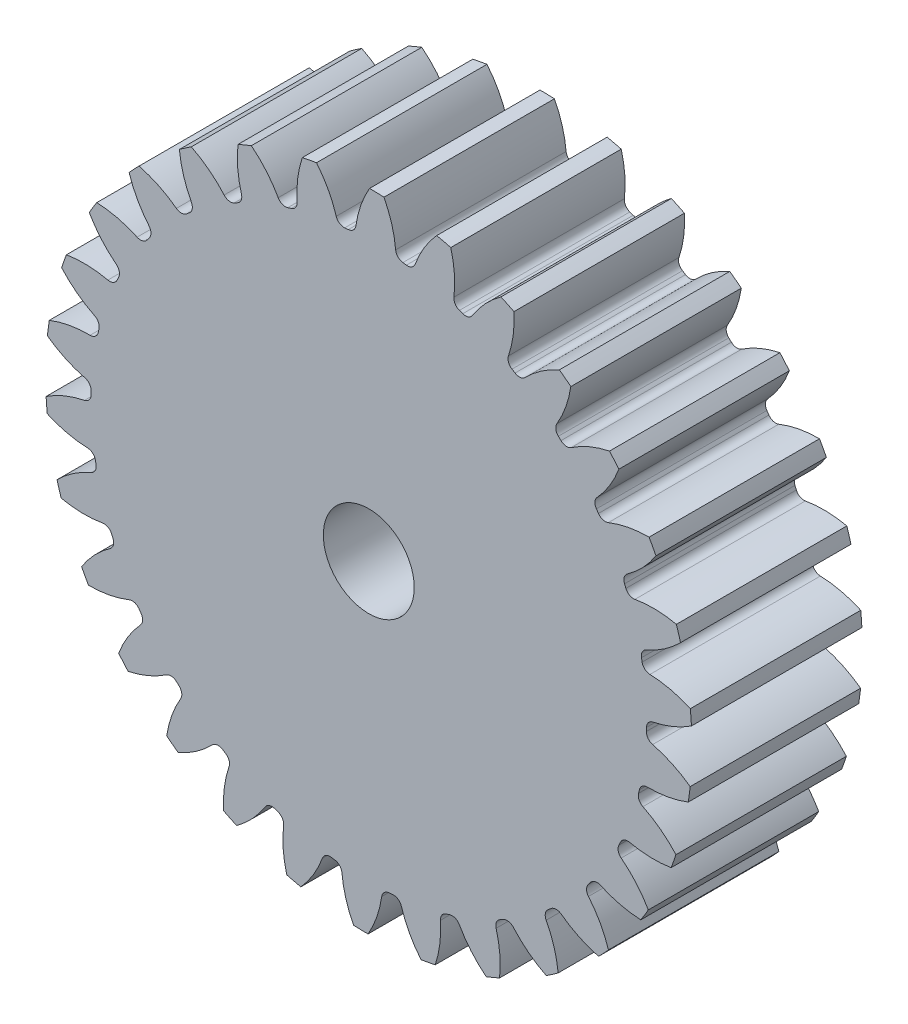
from build123d import *

# Parameters (mm, degrees)
SKETCH3_R         = 180.622222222
GEARBODY_DEPTH    = 95.25
TOOTHCUT_DEPTH    = 273.619399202
CIRPATTERN1_COUNT = 30
BOREDIA_R         = 25.4
BORE_DEPTH        = 12700


with BuildPart() as part:
    # Sketch3 → gearBody (new body)
    with BuildSketch(Plane.XY):
        Circle(SKETCH3_R)
    extrude(amount=GEARBODY_DEPTH)

    # Sketch2 → toothCut (cut, through all)
    with BuildSketch(Plane.XY):
        with BuildLine():
            ThreePointArc((155.147172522, -4.826295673), (155.175017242, -3.8278317), (155.196436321, -2.829209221))
            ThreePointArc((155.196436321, -2.829209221), (156.263318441, 0.031684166), (158.887812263, 1.592126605))
            ThreePointArc((158.887812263, 1.592126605), (170.198126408, 5.03637636), (180.622222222, 10.615291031))
            ThreePointArc((180.622222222, 10.615291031), (180.878863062, -4.461889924), (179.8791439, -19.508079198))
            ThreePointArc((179.8791439, -19.508079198), (169.742798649, -13.421982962), (158.616061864, -9.42425974))
            ThreePointArc((158.616061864, -9.42425974), (156.071698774, -7.736312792), (155.147172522, -4.826295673))
        make_face()
    toothcut = extrude(amount=TOOTHCUT_DEPTH, mode=Mode.SUBTRACT)

    # CirPattern1: toothCut ×30 about axis
    cirpattern1_axis = Axis((0, 0, 0), (0, 0, 1))
    for i in range(1, CIRPATTERN1_COUNT):
        add(toothcut.rotate(cirpattern1_axis, i * 360 / CIRPATTERN1_COUNT), mode=Mode.SUBTRACT)

    # boreDia → bore (cut, symmetric)
    with BuildSketch(Plane.XY):
        Circle(BOREDIA_R)
    extrude(amount=BORE_DEPTH, both=True, mode=Mode.SUBTRACT)


solid = part.part
